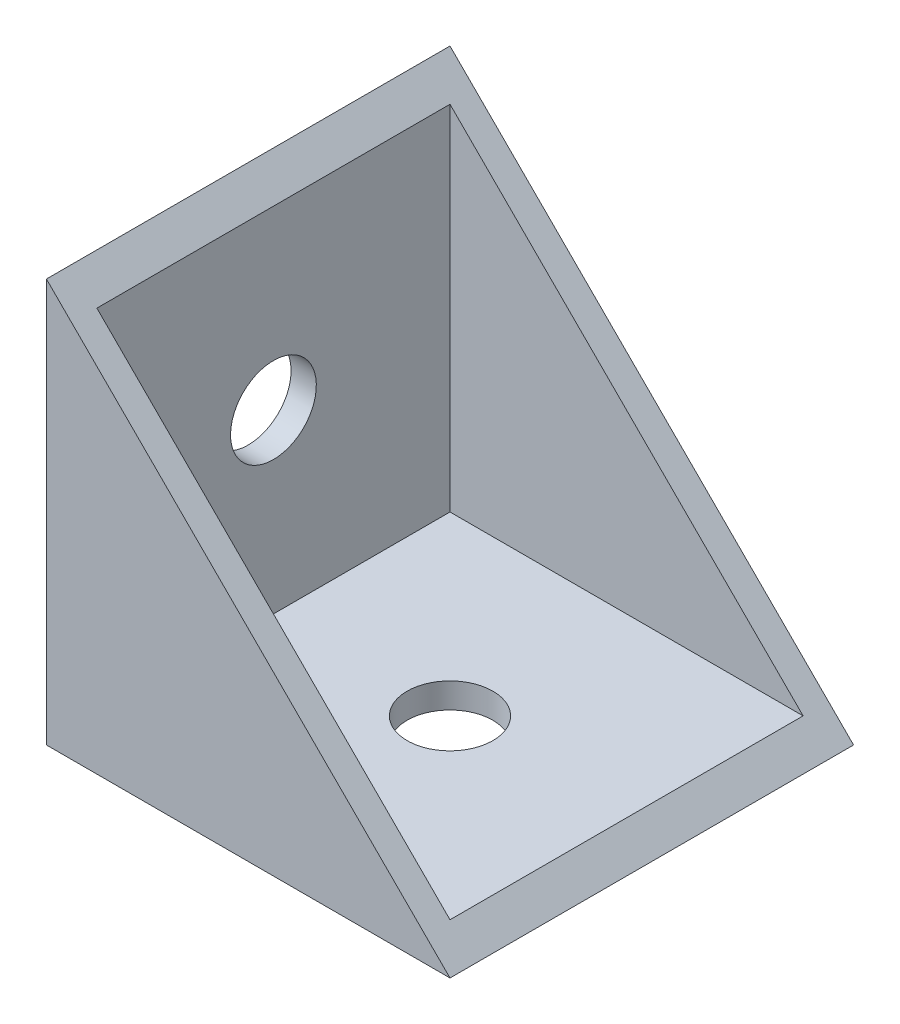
ISO-10303-21;
HEADER;
FILE_DESCRIPTION(('STEP AP214'),'2;1');
FILE_NAME('part.step','',(''),(''),'','','');
FILE_SCHEMA(('AUTOMOTIVE_DESIGN { 1 0 10303 214 1 1 1 1 }'));
ENDSEC;
DATA;
#1=APPLICATION_CONTEXT('core data for automotive mechanical design processes');
#2=APPLICATION_PROTOCOL_DEFINITION('international standard','automotive_design',2000,#1);
#3=PRODUCT_CONTEXT('',#1,'mechanical');
#4=PRODUCT('Part','Part','',(#3));
#5=PRODUCT_RELATED_PRODUCT_CATEGORY('part','',(#4));
#6=PRODUCT_DEFINITION_FORMATION('','',#4);
#7=PRODUCT_DEFINITION_CONTEXT('part definition',#1,'design');
#8=PRODUCT_DEFINITION('design','',#6,#7);
#9=PRODUCT_DEFINITION_SHAPE('','',#8);
#10=(LENGTH_UNIT() NAMED_UNIT(*) SI_UNIT(.MILLI.,.METRE.));
#11=(NAMED_UNIT(*) PLANE_ANGLE_UNIT() SI_UNIT($,.RADIAN.));
#12=(NAMED_UNIT(*) SI_UNIT($,.STERADIAN.) SOLID_ANGLE_UNIT());
#13=UNCERTAINTY_MEASURE_WITH_UNIT(LENGTH_MEASURE(1.E-05),#10,'distance_accuracy_value','');
#14=(GEOMETRIC_REPRESENTATION_CONTEXT(3) GLOBAL_UNCERTAINTY_ASSIGNED_CONTEXT((#13)) GLOBAL_UNIT_ASSIGNED_CONTEXT((#10,
#11,#12)) REPRESENTATION_CONTEXT('',''));
#15=CARTESIAN_POINT('',(0.,0.,0.));
#16=DIRECTION('',(0.,0.,1.));
#17=DIRECTION('',(1.,0.,0.));
#18=AXIS2_PLACEMENT_3D('',#15,#16,#17);
#19=CARTESIAN_POINT('',(40.,20.,0.));
#20=DIRECTION('',(-1.,0.,0.));
#21=DIRECTION('',(0.,-1.,0.));
#22=AXIS2_PLACEMENT_3D('',#19,#20,#21);
#23=CYLINDRICAL_SURFACE('',#22,4.25);
#24=CARTESIAN_POINT('',(2.5,20.,0.));
#25=DIRECTION('',(-1.,0.,0.));
#26=DIRECTION('',(0.,-1.,0.));
#27=AXIS2_PLACEMENT_3D('',#24,#25,#26);
#28=CIRCLE('',#27,4.25);
#29=CARTESIAN_POINT('',(2.5,15.75,0.));
#30=VERTEX_POINT('',#29);
#31=EDGE_CURVE('E19',#30,#30,#28,.T.);
#32=ORIENTED_EDGE('',*,*,#31,.F.);
#33=EDGE_LOOP('',(#32));
#34=FACE_BOUND('',#33,.T.);
#35=CARTESIAN_POINT('',(0.,20.,0.));
#36=DIRECTION('',(-1.,0.,0.));
#37=DIRECTION('',(0.,-1.,0.));
#38=AXIS2_PLACEMENT_3D('',#35,#36,#37);
#39=CIRCLE('',#38,4.25);
#40=CARTESIAN_POINT('',(0.,15.75,0.));
#41=VERTEX_POINT('',#40);
#42=EDGE_CURVE('E100',#41,#41,#39,.T.);
#43=ORIENTED_EDGE('',*,*,#42,.T.);
#44=EDGE_LOOP('',(#43));
#45=FACE_BOUND('',#44,.T.);
#46=ADVANCED_FACE('F16',(#34,#45),#23,.F.);
#47=CARTESIAN_POINT('',(2.5,40.,20.));
#48=DIRECTION('',(1.,0.,0.));
#49=DIRECTION('',(0.,1.,0.));
#50=AXIS2_PLACEMENT_3D('',#47,#48,#49);
#51=PLANE('',#50);
#52=DIRECTION('',(0.,1.,0.));
#53=VECTOR('',#52,1.);
#54=CARTESIAN_POINT('',(2.5,40.,17.5));
#55=LINE('',#54,#53);
#56=CARTESIAN_POINT('',(2.5,37.5,17.5));
#57=VERTEX_POINT('',#56);
#58=CARTESIAN_POINT('',(2.5,2.5,17.5));
#59=VERTEX_POINT('',#58);
#60=EDGE_CURVE('E80',#57,#59,#55,.F.);
#61=ORIENTED_EDGE('',*,*,#60,.T.);
#62=DIRECTION('',(0.,0.,1.));
#63=VECTOR('',#62,1.);
#64=CARTESIAN_POINT('',(2.5,2.5,20.));
#65=LINE('',#64,#63);
#66=CARTESIAN_POINT('',(2.5,2.5,-17.5));
#67=VERTEX_POINT('',#66);
#68=EDGE_CURVE('E70',#67,#59,#65,.T.);
#69=ORIENTED_EDGE('',*,*,#68,.F.);
#70=DIRECTION('',(0.,1.,0.));
#71=VECTOR('',#70,1.);
#72=CARTESIAN_POINT('',(2.5,40.,-17.5));
#73=LINE('',#72,#71);
#74=CARTESIAN_POINT('',(2.5,37.5,-17.5));
#75=VERTEX_POINT('',#74);
#76=EDGE_CURVE('E65',#75,#67,#73,.F.);
#77=ORIENTED_EDGE('',*,*,#76,.F.);
#78=DIRECTION('',(0.,0.,1.));
#79=VECTOR('',#78,1.);
#80=CARTESIAN_POINT('',(2.5,37.5,20.));
#81=LINE('',#80,#79);
#82=EDGE_CURVE('E85',#75,#57,#81,.T.);
#83=ORIENTED_EDGE('',*,*,#82,.T.);
#84=EDGE_LOOP('',(#61,#69,#77,#83));
#85=FACE_BOUND('',#84,.T.);
#86=ORIENTED_EDGE('',*,*,#31,.T.);
#87=EDGE_LOOP('',(#86));
#88=FACE_BOUND('',#87,.T.);
#89=ADVANCED_FACE('F83',(#85,#88),#51,.T.);
#90=CARTESIAN_POINT('',(0.,40.,17.5));
#91=DIRECTION('',(0.,0.,1.));
#92=DIRECTION('',(1.,0.,0.));
#93=AXIS2_PLACEMENT_3D('',#90,#91,#92);
#94=PLANE('',#93);
#95=DIRECTION('',(1.,0.,0.));
#96=VECTOR('',#95,1.);
#97=CARTESIAN_POINT('',(0.,2.5,17.5));
#98=LINE('',#97,#96);
#99=CARTESIAN_POINT('',(37.5,2.5,17.5));
#100=VERTEX_POINT('',#99);
#101=EDGE_CURVE('E76',#59,#100,#98,.T.);
#102=ORIENTED_EDGE('',*,*,#101,.F.);
#103=ORIENTED_EDGE('',*,*,#60,.F.);
#104=DIRECTION('',(0.707106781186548,-0.707106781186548,0.));
#105=VECTOR('',#104,1.);
#106=CARTESIAN_POINT('',(40.,0.,17.5));
#107=LINE('',#106,#105);
#108=EDGE_CURVE('E91',#57,#100,#107,.T.);
#109=ORIENTED_EDGE('',*,*,#108,.T.);
#110=EDGE_LOOP('',(#102,#103,#109));
#111=FACE_BOUND('',#110,.T.);
#112=ADVANCED_FACE('F90',(#111),#94,.F.);
#113=CARTESIAN_POINT('',(0.,2.5,20.));
#114=DIRECTION('',(0.,1.,0.));
#115=DIRECTION('',(0.,0.,1.));
#116=AXIS2_PLACEMENT_3D('',#113,#114,#115);
#117=PLANE('',#116);
#118=ORIENTED_EDGE('',*,*,#101,.T.);
#119=DIRECTION('',(0.,0.,1.));
#120=VECTOR('',#119,1.);
#121=CARTESIAN_POINT('',(37.5,2.5,20.));
#122=LINE('',#121,#120);
#123=CARTESIAN_POINT('',(37.5,2.5,-17.5));
#124=VERTEX_POINT('',#123);
#125=EDGE_CURVE('E117',#100,#124,#122,.F.);
#126=ORIENTED_EDGE('',*,*,#125,.T.);
#127=DIRECTION('',(1.,0.,0.));
#128=VECTOR('',#127,1.);
#129=CARTESIAN_POINT('',(0.,2.5,-17.5));
#130=LINE('',#129,#128);
#131=EDGE_CURVE('E78',#67,#124,#130,.T.);
#132=ORIENTED_EDGE('',*,*,#131,.F.);
#133=ORIENTED_EDGE('',*,*,#68,.T.);
#134=EDGE_LOOP('',(#118,#126,#132,#133));
#135=FACE_BOUND('',#134,.T.);
#136=CARTESIAN_POINT('',(20.,2.5,0.));
#137=DIRECTION('',(0.,-1.,0.));
#138=DIRECTION('',(0.,0.,-1.));
#139=AXIS2_PLACEMENT_3D('',#136,#137,#138);
#140=CIRCLE('',#139,4.25);
#141=CARTESIAN_POINT('',(20.,2.5,-4.25));
#142=VERTEX_POINT('',#141);
#143=EDGE_CURVE('E103',#142,#142,#140,.T.);
#144=ORIENTED_EDGE('',*,*,#143,.T.);
#145=EDGE_LOOP('',(#144));
#146=FACE_BOUND('',#145,.T.);
#147=ADVANCED_FACE('F72',(#135,#146),#117,.T.);
#148=CARTESIAN_POINT('',(0.,40.,-17.5));
#149=DIRECTION('',(0.,0.,1.));
#150=DIRECTION('',(1.,0.,0.));
#151=AXIS2_PLACEMENT_3D('',#148,#149,#150);
#152=PLANE('',#151);
#153=ORIENTED_EDGE('',*,*,#76,.T.);
#154=ORIENTED_EDGE('',*,*,#131,.T.);
#155=DIRECTION('',(0.707106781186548,-0.707106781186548,0.));
#156=VECTOR('',#155,1.);
#157=CARTESIAN_POINT('',(40.,0.,-17.5));
#158=LINE('',#157,#156);
#159=EDGE_CURVE('E119',#124,#75,#158,.F.);
#160=ORIENTED_EDGE('',*,*,#159,.T.);
#161=EDGE_LOOP('',(#153,#154,#160));
#162=FACE_BOUND('',#161,.T.);
#163=ADVANCED_FACE('F163',(#162),#152,.T.);
#164=CARTESIAN_POINT('',(20.,40.,0.));
#165=DIRECTION('',(0.,-1.,0.));
#166=DIRECTION('',(0.,0.,-1.));
#167=AXIS2_PLACEMENT_3D('',#164,#165,#166);
#168=CYLINDRICAL_SURFACE('',#167,4.25);
#169=ORIENTED_EDGE('',*,*,#143,.F.);
#170=EDGE_LOOP('',(#169));
#171=FACE_BOUND('',#170,.T.);
#172=CARTESIAN_POINT('',(20.,0.,0.));
#173=DIRECTION('',(0.,-1.,0.));
#174=DIRECTION('',(0.,0.,-1.));
#175=AXIS2_PLACEMENT_3D('',#172,#173,#174);
#176=CIRCLE('',#175,4.25);
#177=CARTESIAN_POINT('',(20.,0.,-4.25));
#178=VERTEX_POINT('',#177);
#179=EDGE_CURVE('E96',#178,#178,#176,.T.);
#180=ORIENTED_EDGE('',*,*,#179,.T.);
#181=EDGE_LOOP('',(#180));
#182=FACE_BOUND('',#181,.T.);
#183=ADVANCED_FACE('F160',(#171,#182),#168,.F.);
#184=CARTESIAN_POINT('',(0.,40.,20.));
#185=DIRECTION('',(1.,0.,0.));
#186=DIRECTION('',(0.,1.,0.));
#187=AXIS2_PLACEMENT_3D('',#184,#185,#186);
#188=PLANE('',#187);
#189=DIRECTION('',(0.,0.,1.));
#190=VECTOR('',#189,1.);
#191=CARTESIAN_POINT('',(0.,0.,20.));
#192=LINE('',#191,#190);
#193=CARTESIAN_POINT('',(0.,0.,-20.));
#194=VERTEX_POINT('',#193);
#195=CARTESIAN_POINT('',(0.,0.,20.));
#196=VERTEX_POINT('',#195);
#197=EDGE_CURVE('E99',#194,#196,#192,.T.);
#198=ORIENTED_EDGE('',*,*,#197,.T.);
#199=DIRECTION('',(0.,1.,0.));
#200=VECTOR('',#199,1.);
#201=CARTESIAN_POINT('',(0.,40.,20.));
#202=LINE('',#201,#200);
#203=CARTESIAN_POINT('',(0.,40.,20.));
#204=VERTEX_POINT('',#203);
#205=EDGE_CURVE('E102',#204,#196,#202,.F.);
#206=ORIENTED_EDGE('',*,*,#205,.F.);
#207=DIRECTION('',(0.,0.,1.));
#208=VECTOR('',#207,1.);
#209=CARTESIAN_POINT('',(0.,40.,20.));
#210=LINE('',#209,#208);
#211=CARTESIAN_POINT('',(0.,40.,-20.));
#212=VERTEX_POINT('',#211);
#213=EDGE_CURVE('E112',#204,#212,#210,.F.);
#214=ORIENTED_EDGE('',*,*,#213,.T.);
#215=DIRECTION('',(0.,1.,0.));
#216=VECTOR('',#215,1.);
#217=CARTESIAN_POINT('',(0.,40.,-20.));
#218=LINE('',#217,#216);
#219=EDGE_CURVE('E121',#212,#194,#218,.F.);
#220=ORIENTED_EDGE('',*,*,#219,.T.);
#221=EDGE_LOOP('',(#198,#206,#214,#220));
#222=FACE_BOUND('',#221,.T.);
#223=ORIENTED_EDGE('',*,*,#42,.F.);
#224=EDGE_LOOP('',(#223));
#225=FACE_BOUND('',#224,.T.);
#226=ADVANCED_FACE('F142',(#222,#225),#188,.F.);
#227=CARTESIAN_POINT('',(0.,40.,20.));
#228=DIRECTION('',(0.,0.,1.));
#229=DIRECTION('',(1.,0.,0.));
#230=AXIS2_PLACEMENT_3D('',#227,#228,#229);
#231=PLANE('',#230);
#232=ORIENTED_EDGE('',*,*,#205,.T.);
#233=DIRECTION('',(1.,0.,0.));
#234=VECTOR('',#233,1.);
#235=CARTESIAN_POINT('',(0.,0.,20.));
#236=LINE('',#235,#234);
#237=CARTESIAN_POINT('',(40.,0.,20.));
#238=VERTEX_POINT('',#237);
#239=EDGE_CURVE('E127',#196,#238,#236,.T.);
#240=ORIENTED_EDGE('',*,*,#239,.T.);
#241=DIRECTION('',(0.707106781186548,-0.707106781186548,0.));
#242=VECTOR('',#241,1.);
#243=CARTESIAN_POINT('',(40.,0.,20.));
#244=LINE('',#243,#242);
#245=EDGE_CURVE('E109',#238,#204,#244,.F.);
#246=ORIENTED_EDGE('',*,*,#245,.T.);
#247=EDGE_LOOP('',(#232,#240,#246));
#248=FACE_BOUND('',#247,.T.);
#249=ADVANCED_FACE('F140',(#248),#231,.T.);
#250=CARTESIAN_POINT('',(40.,0.,20.));
#251=DIRECTION('',(-0.707106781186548,-0.707106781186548,0.));
#252=DIRECTION('',(0.707106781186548,-0.707106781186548,0.));
#253=AXIS2_PLACEMENT_3D('',#250,#251,#252);
#254=PLANE('',#253);
#255=ORIENTED_EDGE('',*,*,#125,.F.);
#256=ORIENTED_EDGE('',*,*,#108,.F.);
#257=ORIENTED_EDGE('',*,*,#82,.F.);
#258=ORIENTED_EDGE('',*,*,#159,.F.);
#259=EDGE_LOOP('',(#255,#256,#257,#258));
#260=FACE_BOUND('',#259,.T.);
#261=ORIENTED_EDGE('',*,*,#213,.F.);
#262=ORIENTED_EDGE('',*,*,#245,.F.);
#263=DIRECTION('',(0.,0.,1.));
#264=VECTOR('',#263,1.);
#265=CARTESIAN_POINT('',(40.,0.,20.));
#266=LINE('',#265,#264);
#267=CARTESIAN_POINT('',(40.,0.,-20.));
#268=VERTEX_POINT('',#267);
#269=EDGE_CURVE('E25',#238,#268,#266,.F.);
#270=ORIENTED_EDGE('',*,*,#269,.T.);
#271=DIRECTION('',(-0.707106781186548,0.707106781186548,0.));
#272=VECTOR('',#271,1.);
#273=CARTESIAN_POINT('',(40.,0.,-20.));
#274=LINE('',#273,#272);
#275=EDGE_CURVE('E33',#268,#212,#274,.T.);
#276=ORIENTED_EDGE('',*,*,#275,.T.);
#277=EDGE_LOOP('',(#261,#262,#270,#276));
#278=FACE_BOUND('',#277,.T.);
#279=ADVANCED_FACE('F134',(#260,#278),#254,.F.);
#280=CARTESIAN_POINT('',(0.,40.,-20.));
#281=DIRECTION('',(0.,0.,1.));
#282=DIRECTION('',(1.,0.,0.));
#283=AXIS2_PLACEMENT_3D('',#280,#281,#282);
#284=PLANE('',#283);
#285=DIRECTION('',(1.,0.,0.));
#286=VECTOR('',#285,1.);
#287=CARTESIAN_POINT('',(0.,0.,-20.));
#288=LINE('',#287,#286);
#289=EDGE_CURVE('E11',#268,#194,#288,.F.);
#290=ORIENTED_EDGE('',*,*,#289,.T.);
#291=ORIENTED_EDGE('',*,*,#219,.F.);
#292=ORIENTED_EDGE('',*,*,#275,.F.);
#293=EDGE_LOOP('',(#290,#291,#292));
#294=FACE_BOUND('',#293,.T.);
#295=ADVANCED_FACE('F144',(#294),#284,.F.);
#296=CARTESIAN_POINT('',(0.,0.,20.));
#297=DIRECTION('',(0.,1.,0.));
#298=DIRECTION('',(0.,0.,1.));
#299=AXIS2_PLACEMENT_3D('',#296,#297,#298);
#300=PLANE('',#299);
#301=ORIENTED_EDGE('',*,*,#269,.F.);
#302=ORIENTED_EDGE('',*,*,#239,.F.);
#303=ORIENTED_EDGE('',*,*,#197,.F.);
#304=ORIENTED_EDGE('',*,*,#289,.F.);
#305=EDGE_LOOP('',(#301,#302,#303,#304));
#306=FACE_BOUND('',#305,.T.);
#307=ORIENTED_EDGE('',*,*,#179,.F.);
#308=EDGE_LOOP('',(#307));
#309=FACE_BOUND('',#308,.T.);
#310=ADVANCED_FACE('F137',(#306,#309),#300,.F.);
#311=CLOSED_SHELL('',(#46,#89,#112,#147,#163,#183,#226,#249,#279,#295,#310));
#312=MANIFOLD_SOLID_BREP('B1',#311);
#313=ADVANCED_BREP_SHAPE_REPRESENTATION('',(#18,#312),#14);
#314=SHAPE_DEFINITION_REPRESENTATION(#9,#313);
ENDSEC;
END-ISO-10303-21;
